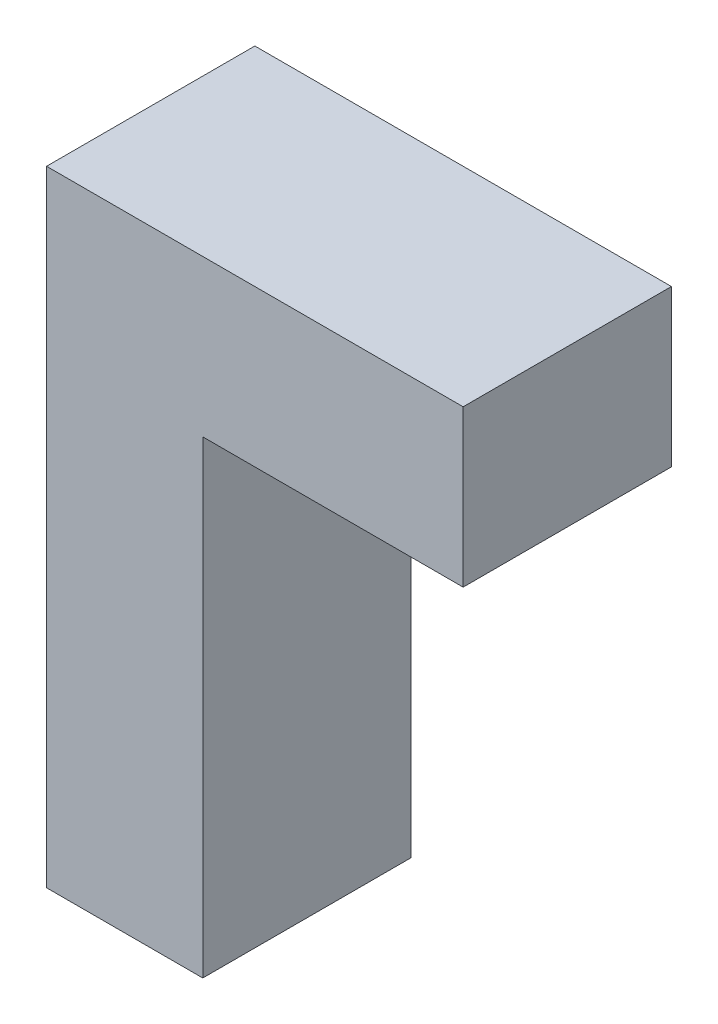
ISO-10303-21;
HEADER;
FILE_DESCRIPTION(('STEP AP214'),'2;1');
FILE_NAME('part.step','',(''),(''),'','','');
FILE_SCHEMA(('AUTOMOTIVE_DESIGN { 1 0 10303 214 1 1 1 1 }'));
ENDSEC;
DATA;
#1=APPLICATION_CONTEXT('core data for automotive mechanical design processes');
#2=APPLICATION_PROTOCOL_DEFINITION('international standard','automotive_design',2000,#1);
#3=PRODUCT_CONTEXT('',#1,'mechanical');
#4=PRODUCT('Part','Part','',(#3));
#5=PRODUCT_RELATED_PRODUCT_CATEGORY('part','',(#4));
#6=PRODUCT_DEFINITION_FORMATION('','',#4);
#7=PRODUCT_DEFINITION_CONTEXT('part definition',#1,'design');
#8=PRODUCT_DEFINITION('design','',#6,#7);
#9=PRODUCT_DEFINITION_SHAPE('','',#8);
#10=(LENGTH_UNIT() NAMED_UNIT(*) SI_UNIT(.MILLI.,.METRE.));
#11=(NAMED_UNIT(*) PLANE_ANGLE_UNIT() SI_UNIT($,.RADIAN.));
#12=(NAMED_UNIT(*) SI_UNIT($,.STERADIAN.) SOLID_ANGLE_UNIT());
#13=UNCERTAINTY_MEASURE_WITH_UNIT(LENGTH_MEASURE(1.E-05),#10,'distance_accuracy_value','');
#14=(GEOMETRIC_REPRESENTATION_CONTEXT(3) GLOBAL_UNCERTAINTY_ASSIGNED_CONTEXT((#13)) GLOBAL_UNIT_ASSIGNED_CONTEXT((#10,
#11,#12)) REPRESENTATION_CONTEXT('',''));
#15=CARTESIAN_POINT('',(0.,0.,0.));
#16=DIRECTION('',(0.,0.,1.));
#17=DIRECTION('',(1.,0.,0.));
#18=AXIS2_PLACEMENT_3D('',#15,#16,#17);
#19=CARTESIAN_POINT('',(0.,76.2,25.4));
#20=DIRECTION('',(1.,0.,0.));
#21=DIRECTION('',(0.,1.,0.));
#22=AXIS2_PLACEMENT_3D('',#19,#20,#21);
#23=PLANE('',#22);
#24=DIRECTION('',(0.,-1.,0.));
#25=VECTOR('',#24,1.);
#26=CARTESIAN_POINT('',(0.,76.2,0.));
#27=LINE('',#26,#25);
#28=CARTESIAN_POINT('',(0.,76.2,0.));
#29=VERTEX_POINT('',#28);
#30=CARTESIAN_POINT('',(0.,0.,0.));
#31=VERTEX_POINT('',#30);
#32=EDGE_CURVE('E116',#29,#31,#27,.T.);
#33=ORIENTED_EDGE('',*,*,#32,.T.);
#34=DIRECTION('',(0.,0.,-1.));
#35=VECTOR('',#34,1.);
#36=CARTESIAN_POINT('',(0.,0.,25.4));
#37=LINE('',#36,#35);
#38=CARTESIAN_POINT('',(0.,0.,25.4));
#39=VERTEX_POINT('',#38);
#40=EDGE_CURVE('E11',#39,#31,#37,.T.);
#41=ORIENTED_EDGE('',*,*,#40,.F.);
#42=DIRECTION('',(0.,-1.,0.));
#43=VECTOR('',#42,1.);
#44=CARTESIAN_POINT('',(0.,76.2,25.4));
#45=LINE('',#44,#43);
#46=CARTESIAN_POINT('',(0.,76.2,25.4));
#47=VERTEX_POINT('',#46);
#48=EDGE_CURVE('E126',#47,#39,#45,.T.);
#49=ORIENTED_EDGE('',*,*,#48,.F.);
#50=DIRECTION('',(0.,0.,-1.));
#51=VECTOR('',#50,1.);
#52=CARTESIAN_POINT('',(0.,76.2,25.4));
#53=LINE('',#52,#51);
#54=EDGE_CURVE('E112',#47,#29,#53,.T.);
#55=ORIENTED_EDGE('',*,*,#54,.T.);
#56=EDGE_LOOP('',(#33,#41,#49,#55));
#57=FACE_BOUND('',#56,.T.);
#58=ADVANCED_FACE('F32',(#57),#23,.F.);
#59=CARTESIAN_POINT('',(0.,0.,25.4));
#60=DIRECTION('',(0.,1.,0.));
#61=DIRECTION('',(0.,0.,1.));
#62=AXIS2_PLACEMENT_3D('',#59,#60,#61);
#63=PLANE('',#62);
#64=DIRECTION('',(1.,0.,0.));
#65=VECTOR('',#64,1.);
#66=CARTESIAN_POINT('',(0.,0.,0.));
#67=LINE('',#66,#65);
#68=CARTESIAN_POINT('',(19.05,0.,0.));
#69=VERTEX_POINT('',#68);
#70=EDGE_CURVE('E119',#31,#69,#67,.T.);
#71=ORIENTED_EDGE('',*,*,#70,.T.);
#72=DIRECTION('',(0.,0.,-1.));
#73=VECTOR('',#72,1.);
#74=CARTESIAN_POINT('',(19.05,0.,25.4));
#75=LINE('',#74,#73);
#76=CARTESIAN_POINT('',(19.05,0.,25.4));
#77=VERTEX_POINT('',#76);
#78=EDGE_CURVE('E40',#77,#69,#75,.T.);
#79=ORIENTED_EDGE('',*,*,#78,.F.);
#80=DIRECTION('',(1.,0.,0.));
#81=VECTOR('',#80,1.);
#82=CARTESIAN_POINT('',(0.,0.,25.4));
#83=LINE('',#82,#81);
#84=EDGE_CURVE('E85',#39,#77,#83,.T.);
#85=ORIENTED_EDGE('',*,*,#84,.F.);
#86=ORIENTED_EDGE('',*,*,#40,.T.);
#87=EDGE_LOOP('',(#71,#79,#85,#86));
#88=FACE_BOUND('',#87,.T.);
#89=ADVANCED_FACE('F150',(#88),#63,.F.);
#90=CARTESIAN_POINT('',(19.05,0.,25.4));
#91=DIRECTION('',(-1.,0.,0.));
#92=DIRECTION('',(0.,0.,1.));
#93=AXIS2_PLACEMENT_3D('',#90,#91,#92);
#94=PLANE('',#93);
#95=DIRECTION('',(0.,1.,0.));
#96=VECTOR('',#95,1.);
#97=CARTESIAN_POINT('',(19.05,0.,0.));
#98=LINE('',#97,#96);
#99=CARTESIAN_POINT('',(19.05,57.15,0.));
#100=VERTEX_POINT('',#99);
#101=EDGE_CURVE('E121',#69,#100,#98,.T.);
#102=ORIENTED_EDGE('',*,*,#101,.T.);
#103=DIRECTION('',(0.,0.,-1.));
#104=VECTOR('',#103,1.);
#105=CARTESIAN_POINT('',(19.05,57.15,25.4));
#106=LINE('',#105,#104);
#107=CARTESIAN_POINT('',(19.05,57.15,25.4));
#108=VERTEX_POINT('',#107);
#109=EDGE_CURVE('E107',#108,#100,#106,.T.);
#110=ORIENTED_EDGE('',*,*,#109,.F.);
#111=DIRECTION('',(0.,1.,0.));
#112=VECTOR('',#111,1.);
#113=CARTESIAN_POINT('',(19.05,0.,25.4));
#114=LINE('',#113,#112);
#115=EDGE_CURVE('E98',#77,#108,#114,.T.);
#116=ORIENTED_EDGE('',*,*,#115,.F.);
#117=ORIENTED_EDGE('',*,*,#78,.T.);
#118=EDGE_LOOP('',(#102,#110,#116,#117));
#119=FACE_BOUND('',#118,.T.);
#120=ADVANCED_FACE('F132',(#119),#94,.F.);
#121=CARTESIAN_POINT('',(19.05,57.15,25.4));
#122=DIRECTION('',(0.,1.,0.));
#123=DIRECTION('',(0.,0.,1.));
#124=AXIS2_PLACEMENT_3D('',#121,#122,#123);
#125=PLANE('',#124);
#126=DIRECTION('',(1.,0.,0.));
#127=VECTOR('',#126,1.);
#128=CARTESIAN_POINT('',(19.05,57.15,0.));
#129=LINE('',#128,#127);
#130=CARTESIAN_POINT('',(50.8,57.15,0.));
#131=VERTEX_POINT('',#130);
#132=EDGE_CURVE('E106',#100,#131,#129,.T.);
#133=ORIENTED_EDGE('',*,*,#132,.T.);
#134=DIRECTION('',(0.,0.,-1.));
#135=VECTOR('',#134,1.);
#136=CARTESIAN_POINT('',(50.8,57.15,25.4));
#137=LINE('',#136,#135);
#138=CARTESIAN_POINT('',(50.8,57.15,25.4));
#139=VERTEX_POINT('',#138);
#140=EDGE_CURVE('E103',#139,#131,#137,.T.);
#141=ORIENTED_EDGE('',*,*,#140,.F.);
#142=DIRECTION('',(1.,0.,0.));
#143=VECTOR('',#142,1.);
#144=CARTESIAN_POINT('',(19.05,57.15,25.4));
#145=LINE('',#144,#143);
#146=EDGE_CURVE('E92',#108,#139,#145,.T.);
#147=ORIENTED_EDGE('',*,*,#146,.F.);
#148=ORIENTED_EDGE('',*,*,#109,.T.);
#149=EDGE_LOOP('',(#133,#141,#147,#148));
#150=FACE_BOUND('',#149,.T.);
#151=ADVANCED_FACE('F104',(#150),#125,.F.);
#152=CARTESIAN_POINT('',(50.8,57.15,25.4));
#153=DIRECTION('',(-1.,0.,0.));
#154=DIRECTION('',(0.,0.,1.));
#155=AXIS2_PLACEMENT_3D('',#152,#153,#154);
#156=PLANE('',#155);
#157=DIRECTION('',(0.,1.,0.));
#158=VECTOR('',#157,1.);
#159=CARTESIAN_POINT('',(50.8,57.15,0.));
#160=LINE('',#159,#158);
#161=CARTESIAN_POINT('',(50.8,76.2,0.));
#162=VERTEX_POINT('',#161);
#163=EDGE_CURVE('E71',#131,#162,#160,.T.);
#164=ORIENTED_EDGE('',*,*,#163,.T.);
#165=DIRECTION('',(0.,0.,-1.));
#166=VECTOR('',#165,1.);
#167=CARTESIAN_POINT('',(50.8,76.2,25.4));
#168=LINE('',#167,#166);
#169=CARTESIAN_POINT('',(50.8,76.2,25.4));
#170=VERTEX_POINT('',#169);
#171=EDGE_CURVE('E108',#170,#162,#168,.T.);
#172=ORIENTED_EDGE('',*,*,#171,.F.);
#173=DIRECTION('',(0.,1.,0.));
#174=VECTOR('',#173,1.);
#175=CARTESIAN_POINT('',(50.8,57.15,25.4));
#176=LINE('',#175,#174);
#177=EDGE_CURVE('E96',#139,#170,#176,.T.);
#178=ORIENTED_EDGE('',*,*,#177,.F.);
#179=ORIENTED_EDGE('',*,*,#140,.T.);
#180=EDGE_LOOP('',(#164,#172,#178,#179));
#181=FACE_BOUND('',#180,.T.);
#182=ADVANCED_FACE('F110',(#181),#156,.F.);
#183=CARTESIAN_POINT('',(50.8,76.2,25.4));
#184=DIRECTION('',(0.,-1.,0.));
#185=DIRECTION('',(0.,0.,-1.));
#186=AXIS2_PLACEMENT_3D('',#183,#184,#185);
#187=PLANE('',#186);
#188=DIRECTION('',(-1.,0.,0.));
#189=VECTOR('',#188,1.);
#190=CARTESIAN_POINT('',(50.8,76.2,0.));
#191=LINE('',#190,#189);
#192=EDGE_CURVE('E77',#162,#29,#191,.T.);
#193=ORIENTED_EDGE('',*,*,#192,.T.);
#194=ORIENTED_EDGE('',*,*,#54,.F.);
#195=DIRECTION('',(-1.,0.,0.));
#196=VECTOR('',#195,1.);
#197=CARTESIAN_POINT('',(50.8,76.2,25.4));
#198=LINE('',#197,#196);
#199=EDGE_CURVE('E48',#170,#47,#198,.T.);
#200=ORIENTED_EDGE('',*,*,#199,.F.);
#201=ORIENTED_EDGE('',*,*,#171,.T.);
#202=EDGE_LOOP('',(#193,#194,#200,#201));
#203=FACE_BOUND('',#202,.T.);
#204=ADVANCED_FACE('F139',(#203),#187,.F.);
#205=CARTESIAN_POINT('',(0.,0.,25.4));
#206=DIRECTION('',(0.,0.,1.));
#207=DIRECTION('',(1.,0.,0.));
#208=AXIS2_PLACEMENT_3D('',#205,#206,#207);
#209=PLANE('',#208);
#210=ORIENTED_EDGE('',*,*,#48,.T.);
#211=ORIENTED_EDGE('',*,*,#84,.T.);
#212=ORIENTED_EDGE('',*,*,#115,.T.);
#213=ORIENTED_EDGE('',*,*,#146,.T.);
#214=ORIENTED_EDGE('',*,*,#177,.T.);
#215=ORIENTED_EDGE('',*,*,#199,.T.);
#216=EDGE_LOOP('',(#210,#211,#212,#213,#214,#215));
#217=FACE_BOUND('',#216,.T.);
#218=ADVANCED_FACE('F94',(#217),#209,.T.);
#219=CARTESIAN_POINT('',(0.,0.,0.));
#220=DIRECTION('',(0.,0.,1.));
#221=DIRECTION('',(1.,0.,0.));
#222=AXIS2_PLACEMENT_3D('',#219,#220,#221);
#223=PLANE('',#222);
#224=ORIENTED_EDGE('',*,*,#32,.F.);
#225=ORIENTED_EDGE('',*,*,#192,.F.);
#226=ORIENTED_EDGE('',*,*,#163,.F.);
#227=ORIENTED_EDGE('',*,*,#132,.F.);
#228=ORIENTED_EDGE('',*,*,#101,.F.);
#229=ORIENTED_EDGE('',*,*,#70,.F.);
#230=EDGE_LOOP('',(#224,#225,#226,#227,#228,#229));
#231=FACE_BOUND('',#230,.T.);
#232=ADVANCED_FACE('F135',(#231),#223,.F.);
#233=CLOSED_SHELL('',(#58,#89,#120,#151,#182,#204,#218,#232));
#234=MANIFOLD_SOLID_BREP('B2',#233);
#235=ADVANCED_BREP_SHAPE_REPRESENTATION('',(#18,#234),#14);
#236=SHAPE_DEFINITION_REPRESENTATION(#9,#235);
ENDSEC;
END-ISO-10303-21;
